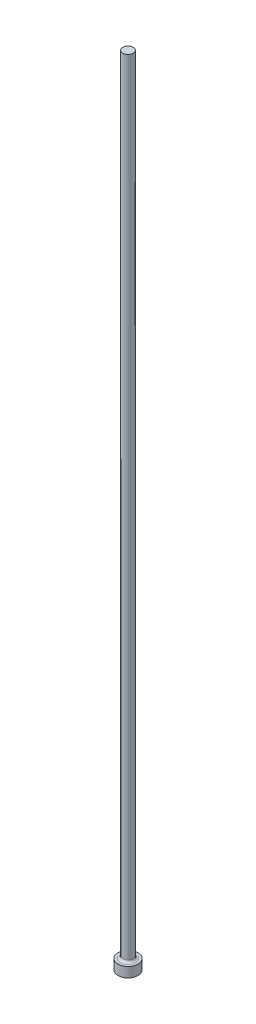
ISO-10303-21;
HEADER;
FILE_DESCRIPTION(('STEP AP214'),'2;1');
FILE_NAME('part.step','',(''),(''),'','','');
FILE_SCHEMA(('AUTOMOTIVE_DESIGN { 1 0 10303 214 1 1 1 1 }'));
ENDSEC;
DATA;
#1=APPLICATION_CONTEXT('core data for automotive mechanical design processes');
#2=APPLICATION_PROTOCOL_DEFINITION('international standard','automotive_design',2000,#1);
#3=PRODUCT_CONTEXT('',#1,'mechanical');
#4=PRODUCT('Part','Part','',(#3));
#5=PRODUCT_RELATED_PRODUCT_CATEGORY('part','',(#4));
#6=PRODUCT_DEFINITION_FORMATION('','',#4);
#7=PRODUCT_DEFINITION_CONTEXT('part definition',#1,'design');
#8=PRODUCT_DEFINITION('design','',#6,#7);
#9=PRODUCT_DEFINITION_SHAPE('','',#8);
#10=(LENGTH_UNIT() NAMED_UNIT(*) SI_UNIT(.MILLI.,.METRE.));
#11=(NAMED_UNIT(*) PLANE_ANGLE_UNIT() SI_UNIT($,.RADIAN.));
#12=(NAMED_UNIT(*) SI_UNIT($,.STERADIAN.) SOLID_ANGLE_UNIT());
#13=UNCERTAINTY_MEASURE_WITH_UNIT(LENGTH_MEASURE(1.E-05),#10,'distance_accuracy_value','');
#14=(GEOMETRIC_REPRESENTATION_CONTEXT(3) GLOBAL_UNCERTAINTY_ASSIGNED_CONTEXT((#13)) GLOBAL_UNIT_ASSIGNED_CONTEXT((#10,
#11,#12)) REPRESENTATION_CONTEXT('',''));
#15=CARTESIAN_POINT('',(0.,0.,0.));
#16=DIRECTION('',(0.,0.,1.));
#17=DIRECTION('',(1.,0.,0.));
#18=AXIS2_PLACEMENT_3D('',#15,#16,#17);
#19=CARTESIAN_POINT('',(1.651,254.,0.));
#20=DIRECTION('',(0.,-1.,0.));
#21=DIRECTION('',(1.,0.,0.));
#22=AXIS2_PLACEMENT_3D('',#19,#20,#21);
#23=PLANE('',#22);
#24=CARTESIAN_POINT('',(0.,254.,0.));
#25=DIRECTION('',(0.,1.,0.));
#26=DIRECTION('',(-1.,0.,0.));
#27=AXIS2_PLACEMENT_3D('',#24,#25,#26);
#28=CIRCLE('',#27,1.65100000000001);
#29=CARTESIAN_POINT('',(-1.65100000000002,254.,0.));
#30=VERTEX_POINT('',#29);
#31=EDGE_CURVE('E10',#30,#30,#28,.T.);
#32=ORIENTED_EDGE('',*,*,#31,.T.);
#33=EDGE_LOOP('',(#32));
#34=FACE_BOUND('',#33,.T.);
#35=ADVANCED_FACE('F30',(#34),#23,.F.);
#36=CARTESIAN_POINT('',(0.,254.,0.));
#37=DIRECTION('',(0.,1.,0.));
#38=DIRECTION('',(-1.,0.,0.));
#39=AXIS2_PLACEMENT_3D('',#36,#37,#38);
#40=CYLINDRICAL_SURFACE('',#39,1.65100000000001);
#41=ORIENTED_EDGE('',*,*,#31,.F.);
#42=EDGE_LOOP('',(#41));
#43=FACE_BOUND('',#42,.T.);
#44=CARTESIAN_POINT('',(0.,3.93700000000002,0.));
#45=DIRECTION('',(0.,1.,0.));
#46=DIRECTION('',(-1.,0.,0.));
#47=AXIS2_PLACEMENT_3D('',#44,#45,#46);
#48=CIRCLE('',#47,1.651);
#49=CARTESIAN_POINT('',(-1.651,3.93700000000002,0.));
#50=VERTEX_POINT('',#49);
#51=EDGE_CURVE('E36',#50,#50,#48,.T.);
#52=ORIENTED_EDGE('',*,*,#51,.T.);
#53=EDGE_LOOP('',(#52));
#54=FACE_BOUND('',#53,.T.);
#55=ADVANCED_FACE('F65',(#43,#54),#40,.T.);
#56=CARTESIAN_POINT('',(0.,3.937,0.));
#57=DIRECTION('',(0.,1.,0.));
#58=DIRECTION('',(-1.,0.,0.));
#59=AXIS2_PLACEMENT_3D('',#56,#57,#58);
#60=TOROIDAL_SURFACE('',#59,2.413,0.762);
#61=ORIENTED_EDGE('',*,*,#51,.F.);
#62=EDGE_LOOP('',(#61));
#63=FACE_BOUND('',#62,.T.);
#64=CARTESIAN_POINT('',(0.,3.17499999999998,0.));
#65=DIRECTION('',(0.,1.,0.));
#66=DIRECTION('',(-1.,0.,0.));
#67=AXIS2_PLACEMENT_3D('',#64,#65,#66);
#68=CIRCLE('',#67,2.41300000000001);
#69=CARTESIAN_POINT('',(-2.41300000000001,3.17499999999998,0.));
#70=VERTEX_POINT('',#69);
#71=EDGE_CURVE('E40',#70,#70,#68,.T.);
#72=ORIENTED_EDGE('',*,*,#71,.T.);
#73=EDGE_LOOP('',(#72));
#74=FACE_BOUND('',#73,.T.);
#75=ADVANCED_FACE('F69',(#63,#74),#60,.F.);
#76=CARTESIAN_POINT('',(3.175,3.175,0.));
#77=DIRECTION('',(0.,-1.,0.));
#78=DIRECTION('',(1.,0.,0.));
#79=AXIS2_PLACEMENT_3D('',#76,#77,#78);
#80=PLANE('',#79);
#81=ORIENTED_EDGE('',*,*,#71,.F.);
#82=EDGE_LOOP('',(#81));
#83=FACE_BOUND('',#82,.T.);
#84=CARTESIAN_POINT('',(0.,3.17499999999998,0.));
#85=DIRECTION('',(0.,1.,0.));
#86=DIRECTION('',(-1.,0.,0.));
#87=AXIS2_PLACEMENT_3D('',#84,#85,#86);
#88=CIRCLE('',#87,3.175);
#89=CARTESIAN_POINT('',(-3.175,3.17499999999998,0.));
#90=VERTEX_POINT('',#89);
#91=EDGE_CURVE('E44',#90,#90,#88,.T.);
#92=ORIENTED_EDGE('',*,*,#91,.T.);
#93=EDGE_LOOP('',(#92));
#94=FACE_BOUND('',#93,.T.);
#95=ADVANCED_FACE('F61',(#83,#94),#80,.F.);
#96=CARTESIAN_POINT('',(0.,254.,0.));
#97=DIRECTION('',(0.,1.,0.));
#98=DIRECTION('',(-1.,0.,0.));
#99=AXIS2_PLACEMENT_3D('',#96,#97,#98);
#100=CYLINDRICAL_SURFACE('',#99,3.175);
#101=ORIENTED_EDGE('',*,*,#91,.F.);
#102=EDGE_LOOP('',(#101));
#103=FACE_BOUND('',#102,.T.);
#104=CARTESIAN_POINT('',(0.,0.,0.));
#105=DIRECTION('',(0.,1.,0.));
#106=DIRECTION('',(-1.,0.,0.));
#107=AXIS2_PLACEMENT_3D('',#104,#105,#106);
#108=CIRCLE('',#107,3.175);
#109=CARTESIAN_POINT('',(-3.175,0.,0.));
#110=VERTEX_POINT('',#109);
#111=EDGE_CURVE('E49',#110,#110,#108,.T.);
#112=ORIENTED_EDGE('',*,*,#111,.T.);
#113=EDGE_LOOP('',(#112));
#114=FACE_BOUND('',#113,.T.);
#115=ADVANCED_FACE('F53',(#103,#114),#100,.T.);
#116=CARTESIAN_POINT('',(0.,0.,0.));
#117=DIRECTION('',(0.,1.,0.));
#118=DIRECTION('',(-1.,0.,0.));
#119=AXIS2_PLACEMENT_3D('',#116,#117,#118);
#120=PLANE('',#119);
#121=ORIENTED_EDGE('',*,*,#111,.F.);
#122=EDGE_LOOP('',(#121));
#123=FACE_BOUND('',#122,.T.);
#124=ADVANCED_FACE('F55',(#123),#120,.F.);
#125=CLOSED_SHELL('',(#35,#55,#75,#95,#115,#124));
#126=MANIFOLD_SOLID_BREP('B2',#125);
#127=ADVANCED_BREP_SHAPE_REPRESENTATION('',(#18,#126),#14);
#128=SHAPE_DEFINITION_REPRESENTATION(#9,#127);
ENDSEC;
END-ISO-10303-21;
